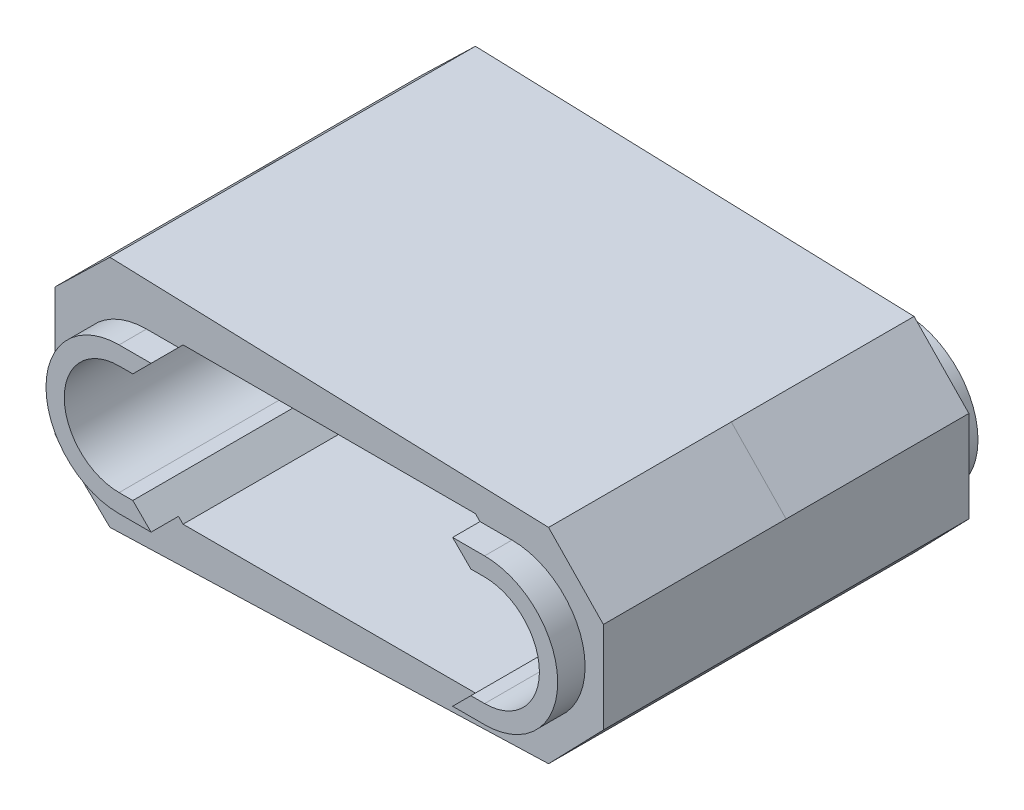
ISO-10303-21;
HEADER;
FILE_DESCRIPTION(('STEP AP214'),'2;1');
FILE_NAME('part.step','',(''),(''),'','','');
FILE_SCHEMA(('AUTOMOTIVE_DESIGN { 1 0 10303 214 1 1 1 1 }'));
ENDSEC;
DATA;
#1=APPLICATION_CONTEXT('core data for automotive mechanical design processes');
#2=APPLICATION_PROTOCOL_DEFINITION('international standard','automotive_design',2000,#1);
#3=PRODUCT_CONTEXT('',#1,'mechanical');
#4=PRODUCT('Part','Part','',(#3));
#5=PRODUCT_RELATED_PRODUCT_CATEGORY('part','',(#4));
#6=PRODUCT_DEFINITION_FORMATION('','',#4);
#7=PRODUCT_DEFINITION_CONTEXT('part definition',#1,'design');
#8=PRODUCT_DEFINITION('design','',#6,#7);
#9=PRODUCT_DEFINITION_SHAPE('','',#8);
#10=(LENGTH_UNIT() NAMED_UNIT(*) SI_UNIT(.MILLI.,.METRE.));
#11=(NAMED_UNIT(*) PLANE_ANGLE_UNIT() SI_UNIT($,.RADIAN.));
#12=(NAMED_UNIT(*) SI_UNIT($,.STERADIAN.) SOLID_ANGLE_UNIT());
#13=UNCERTAINTY_MEASURE_WITH_UNIT(LENGTH_MEASURE(1.E-05),#10,'distance_accuracy_value','');
#14=(GEOMETRIC_REPRESENTATION_CONTEXT(3) GLOBAL_UNCERTAINTY_ASSIGNED_CONTEXT((#13)) GLOBAL_UNIT_ASSIGNED_CONTEXT((#10,
#11,#12)) REPRESENTATION_CONTEXT('',''));
#15=CARTESIAN_POINT('',(0.,0.,0.));
#16=DIRECTION('',(0.,0.,1.));
#17=DIRECTION('',(1.,0.,0.));
#18=AXIS2_PLACEMENT_3D('',#15,#16,#17);
#19=CARTESIAN_POINT('',(0.,-3.,10.));
#20=DIRECTION('',(0.,1.,0.));
#21=DIRECTION('',(-1.,0.,0.));
#22=AXIS2_PLACEMENT_3D('',#19,#20,#21);
#23=PLANE('',#22);
#24=DIRECTION('',(1.,0.,0.));
#25=VECTOR('',#24,1.);
#26=CARTESIAN_POINT('',(0.,-3.,-1.5));
#27=LINE('',#26,#25);
#28=CARTESIAN_POINT('',(24.25,-3.,-1.5));
#29=VERTEX_POINT('',#28);
#30=CARTESIAN_POINT('',(25.,-3.,-1.5));
#31=VERTEX_POINT('',#30);
#32=EDGE_CURVE('E488',#29,#31,#27,.T.);
#33=ORIENTED_EDGE('',*,*,#32,.F.);
#34=DIRECTION('',(0.,0.,1.));
#35=VECTOR('',#34,1.);
#36=CARTESIAN_POINT('',(24.25,-3.,21.5));
#37=LINE('',#36,#35);
#38=CARTESIAN_POINT('',(24.25,-3.,21.5));
#39=VERTEX_POINT('',#38);
#40=EDGE_CURVE('E384',#29,#39,#37,.T.);
#41=ORIENTED_EDGE('',*,*,#40,.T.);
#42=DIRECTION('',(1.,0.,0.));
#43=VECTOR('',#42,1.);
#44=CARTESIAN_POINT('',(0.,-3.,21.5));
#45=LINE('',#44,#43);
#46=CARTESIAN_POINT('',(25.,-3.,21.5));
#47=VERTEX_POINT('',#46);
#48=EDGE_CURVE('E718',#39,#47,#45,.T.);
#49=ORIENTED_EDGE('',*,*,#48,.T.);
#50=DIRECTION('',(0.,0.,-1.));
#51=VECTOR('',#50,1.);
#52=CARTESIAN_POINT('',(25.,-3.,10.));
#53=LINE('',#52,#51);
#54=EDGE_CURVE('E572',#47,#31,#53,.T.);
#55=ORIENTED_EDGE('',*,*,#54,.T.);
#56=EDGE_LOOP('',(#33,#41,#49,#55));
#57=FACE_BOUND('',#56,.T.);
#58=ADVANCED_FACE('F52',(#57),#23,.T.);
#59=CARTESIAN_POINT('',(0.,3.,10.));
#60=DIRECTION('',(0.,1.,0.));
#61=DIRECTION('',(-1.,0.,0.));
#62=AXIS2_PLACEMENT_3D('',#59,#60,#61);
#63=PLANE('',#62);
#64=DIRECTION('',(1.,0.,0.));
#65=VECTOR('',#64,1.);
#66=CARTESIAN_POINT('',(0.,3.,21.5));
#67=LINE('',#66,#65);
#68=CARTESIAN_POINT('',(24.25,3.,21.5));
#69=VERTEX_POINT('',#68);
#70=CARTESIAN_POINT('',(25.,3.,21.5));
#71=VERTEX_POINT('',#70);
#72=EDGE_CURVE('E709',#69,#71,#67,.T.);
#73=ORIENTED_EDGE('',*,*,#72,.F.);
#74=DIRECTION('',(0.,0.,-1.));
#75=VECTOR('',#74,1.);
#76=CARTESIAN_POINT('',(24.25,3.,10.));
#77=LINE('',#76,#75);
#78=CARTESIAN_POINT('',(24.25,3.,-1.5));
#79=VERTEX_POINT('',#78);
#80=EDGE_CURVE('E672',#69,#79,#77,.T.);
#81=ORIENTED_EDGE('',*,*,#80,.T.);
#82=DIRECTION('',(1.,0.,0.));
#83=VECTOR('',#82,1.);
#84=CARTESIAN_POINT('',(0.,3.,-1.5));
#85=LINE('',#84,#83);
#86=CARTESIAN_POINT('',(25.,3.,-1.5));
#87=VERTEX_POINT('',#86);
#88=EDGE_CURVE('E497',#79,#87,#85,.T.);
#89=ORIENTED_EDGE('',*,*,#88,.T.);
#90=DIRECTION('',(0.,0.,-1.));
#91=VECTOR('',#90,1.);
#92=CARTESIAN_POINT('',(25.,3.,10.));
#93=LINE('',#92,#91);
#94=EDGE_CURVE('E562',#71,#87,#93,.T.);
#95=ORIENTED_EDGE('',*,*,#94,.F.);
#96=EDGE_LOOP('',(#73,#81,#89,#95));
#97=FACE_BOUND('',#96,.T.);
#98=ADVANCED_FACE('F910',(#97),#63,.F.);
#99=CARTESIAN_POINT('',(0.,4.,-1.5));
#100=DIRECTION('',(0.,-1.,0.));
#101=DIRECTION('',(0.,0.,-1.));
#102=AXIS2_PLACEMENT_3D('',#99,#100,#101);
#103=PLANE('',#102);
#104=DIRECTION('',(1.,0.,0.));
#105=VECTOR('',#104,1.);
#106=CARTESIAN_POINT('',(0.,4.,-1.5));
#107=LINE('',#106,#105);
#108=CARTESIAN_POINT('',(23.25,4.,-1.5));
#109=VERTEX_POINT('',#108);
#110=CARTESIAN_POINT('',(25.,4.,-1.5));
#111=VERTEX_POINT('',#110);
#112=EDGE_CURVE('E501',#109,#111,#107,.T.);
#113=ORIENTED_EDGE('',*,*,#112,.F.);
#114=DIRECTION('',(0.,0.,-1.));
#115=VECTOR('',#114,1.);
#116=CARTESIAN_POINT('',(23.25,4.,10.));
#117=LINE('',#116,#115);
#118=CARTESIAN_POINT('',(23.25,4.,0.));
#119=VERTEX_POINT('',#118);
#120=EDGE_CURVE('E344',#109,#119,#117,.F.);
#121=ORIENTED_EDGE('',*,*,#120,.T.);
#122=DIRECTION('',(1.,0.,0.));
#123=VECTOR('',#122,1.);
#124=CARTESIAN_POINT('',(0.,4.,0.));
#125=LINE('',#124,#123);
#126=CARTESIAN_POINT('',(25.,4.,0.));
#127=VERTEX_POINT('',#126);
#128=EDGE_CURVE('E484',#119,#127,#125,.T.);
#129=ORIENTED_EDGE('',*,*,#128,.T.);
#130=DIRECTION('',(0.,0.,1.));
#131=VECTOR('',#130,1.);
#132=CARTESIAN_POINT('',(25.,4.,-1.5));
#133=LINE('',#132,#131);
#134=EDGE_CURVE('E533',#111,#127,#133,.T.);
#135=ORIENTED_EDGE('',*,*,#134,.F.);
#136=EDGE_LOOP('',(#113,#121,#129,#135));
#137=FACE_BOUND('',#136,.T.);
#138=ADVANCED_FACE('F690',(#137),#103,.F.);
#139=CARTESIAN_POINT('',(0.,-4.,-1.5));
#140=DIRECTION('',(0.,-1.,0.));
#141=DIRECTION('',(1.,0.,0.));
#142=AXIS2_PLACEMENT_3D('',#139,#140,#141);
#143=PLANE('',#142);
#144=DIRECTION('',(1.,0.,0.));
#145=VECTOR('',#144,1.);
#146=CARTESIAN_POINT('',(0.,-4.,0.));
#147=LINE('',#146,#145);
#148=CARTESIAN_POINT('',(23.25,-4.,0.));
#149=VERTEX_POINT('',#148);
#150=CARTESIAN_POINT('',(25.,-4.,0.));
#151=VERTEX_POINT('',#150);
#152=EDGE_CURVE('E525',#149,#151,#147,.T.);
#153=ORIENTED_EDGE('',*,*,#152,.F.);
#154=DIRECTION('',(0.,0.,-1.));
#155=VECTOR('',#154,1.);
#156=CARTESIAN_POINT('',(23.25,-4.,-1.5));
#157=LINE('',#156,#155);
#158=CARTESIAN_POINT('',(23.25,-4.,-1.5));
#159=VERTEX_POINT('',#158);
#160=EDGE_CURVE('E381',#149,#159,#157,.T.);
#161=ORIENTED_EDGE('',*,*,#160,.T.);
#162=DIRECTION('',(1.,0.,0.));
#163=VECTOR('',#162,1.);
#164=CARTESIAN_POINT('',(0.,-4.,-1.5));
#165=LINE('',#164,#163);
#166=CARTESIAN_POINT('',(25.,-4.,-1.5));
#167=VERTEX_POINT('',#166);
#168=EDGE_CURVE('E509',#159,#167,#165,.T.);
#169=ORIENTED_EDGE('',*,*,#168,.T.);
#170=DIRECTION('',(0.,0.,1.));
#171=VECTOR('',#170,1.);
#172=CARTESIAN_POINT('',(25.,-4.,-1.5));
#173=LINE('',#172,#171);
#174=EDGE_CURVE('E538',#167,#151,#173,.T.);
#175=ORIENTED_EDGE('',*,*,#174,.T.);
#176=EDGE_LOOP('',(#153,#161,#169,#175));
#177=FACE_BOUND('',#176,.T.);
#178=ADVANCED_FACE('F890',(#177),#143,.T.);
#179=CARTESIAN_POINT('',(0.,0.,-1.5));
#180=DIRECTION('',(0.,0.,1.));
#181=DIRECTION('',(1.,0.,0.));
#182=AXIS2_PLACEMENT_3D('',#179,#180,#181);
#183=PLANE('',#182);
#184=ORIENTED_EDGE('',*,*,#88,.F.);
#185=DIRECTION('',(0.707106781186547,-0.707106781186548,0.));
#186=VECTOR('',#185,1.);
#187=CARTESIAN_POINT('',(24.25,3.,-1.5));
#188=LINE('',#187,#186);
#189=EDGE_CURVE('E352',#79,#109,#188,.F.);
#190=ORIENTED_EDGE('',*,*,#189,.T.);
#191=ORIENTED_EDGE('',*,*,#112,.T.);
#192=CARTESIAN_POINT('',(25.,0.,-1.5));
#193=DIRECTION('',(0.,0.,1.));
#194=DIRECTION('',(1.,0.,0.));
#195=AXIS2_PLACEMENT_3D('',#192,#193,#194);
#196=CIRCLE('',#195,4.);
#197=EDGE_CURVE('E513',#167,#111,#196,.T.);
#198=ORIENTED_EDGE('',*,*,#197,.F.);
#199=ORIENTED_EDGE('',*,*,#168,.F.);
#200=DIRECTION('',(0.707106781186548,0.707106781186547,0.));
#201=VECTOR('',#200,1.);
#202=CARTESIAN_POINT('',(23.,-4.25,-1.5));
#203=LINE('',#202,#201);
#204=EDGE_CURVE('E676',#159,#29,#203,.T.);
#205=ORIENTED_EDGE('',*,*,#204,.T.);
#206=ORIENTED_EDGE('',*,*,#32,.T.);
#207=CARTESIAN_POINT('',(25.,0.,-1.5));
#208=DIRECTION('',(0.,0.,1.));
#209=DIRECTION('',(1.,0.,0.));
#210=AXIS2_PLACEMENT_3D('',#207,#208,#209);
#211=CIRCLE('',#210,3.);
#212=EDGE_CURVE('E485',#31,#87,#211,.T.);
#213=ORIENTED_EDGE('',*,*,#212,.T.);
#214=EDGE_LOOP('',(#184,#190,#191,#198,#199,#205,#206,#213));
#215=FACE_BOUND('',#214,.T.);
#216=ADVANCED_FACE('F683',(#215),#183,.F.);
#217=CARTESIAN_POINT('',(0.,4.,21.5));
#218=DIRECTION('',(0.,1.,0.));
#219=DIRECTION('',(0.,0.,1.));
#220=AXIS2_PLACEMENT_3D('',#217,#218,#219);
#221=PLANE('',#220);
#222=DIRECTION('',(1.,0.,0.));
#223=VECTOR('',#222,1.);
#224=CARTESIAN_POINT('',(0.,4.,20.));
#225=LINE('',#224,#223);
#226=CARTESIAN_POINT('',(23.25,4.,20.));
#227=VERTEX_POINT('',#226);
#228=CARTESIAN_POINT('',(25.,4.,20.));
#229=VERTEX_POINT('',#228);
#230=EDGE_CURVE('E432',#227,#229,#225,.T.);
#231=ORIENTED_EDGE('',*,*,#230,.F.);
#232=DIRECTION('',(0.,0.,-1.));
#233=VECTOR('',#232,1.);
#234=CARTESIAN_POINT('',(23.25,4.,21.5));
#235=LINE('',#234,#233);
#236=CARTESIAN_POINT('',(23.25,4.,21.5));
#237=VERTEX_POINT('',#236);
#238=EDGE_CURVE('E372',#227,#237,#235,.F.);
#239=ORIENTED_EDGE('',*,*,#238,.T.);
#240=DIRECTION('',(1.,0.,0.));
#241=VECTOR('',#240,1.);
#242=CARTESIAN_POINT('',(0.,4.,21.5));
#243=LINE('',#242,#241);
#244=CARTESIAN_POINT('',(25.,4.,21.5));
#245=VERTEX_POINT('',#244);
#246=EDGE_CURVE('E723',#237,#245,#243,.T.);
#247=ORIENTED_EDGE('',*,*,#246,.T.);
#248=DIRECTION('',(0.,0.,-1.));
#249=VECTOR('',#248,1.);
#250=CARTESIAN_POINT('',(25.,4.,21.5));
#251=LINE('',#250,#249);
#252=EDGE_CURVE('E465',#245,#229,#251,.T.);
#253=ORIENTED_EDGE('',*,*,#252,.T.);
#254=EDGE_LOOP('',(#231,#239,#247,#253));
#255=FACE_BOUND('',#254,.T.);
#256=ADVANCED_FACE('F759',(#255),#221,.T.);
#257=CARTESIAN_POINT('',(0.,-4.,21.5));
#258=DIRECTION('',(0.,1.,0.));
#259=DIRECTION('',(-1.,0.,0.));
#260=AXIS2_PLACEMENT_3D('',#257,#258,#259);
#261=PLANE('',#260);
#262=DIRECTION('',(1.,0.,0.));
#263=VECTOR('',#262,1.);
#264=CARTESIAN_POINT('',(0.,-4.,21.5));
#265=LINE('',#264,#263);
#266=CARTESIAN_POINT('',(23.25,-4.,21.5));
#267=VERTEX_POINT('',#266);
#268=CARTESIAN_POINT('',(25.,-4.,21.5));
#269=VERTEX_POINT('',#268);
#270=EDGE_CURVE('E729',#267,#269,#265,.T.);
#271=ORIENTED_EDGE('',*,*,#270,.F.);
#272=DIRECTION('',(0.,0.,-1.));
#273=VECTOR('',#272,1.);
#274=CARTESIAN_POINT('',(23.25,-4.,-1.5));
#275=LINE('',#274,#273);
#276=CARTESIAN_POINT('',(23.25,-4.,20.));
#277=VERTEX_POINT('',#276);
#278=EDGE_CURVE('E387',#267,#277,#275,.T.);
#279=ORIENTED_EDGE('',*,*,#278,.T.);
#280=DIRECTION('',(1.,0.,0.));
#281=VECTOR('',#280,1.);
#282=CARTESIAN_POINT('',(0.,-4.,20.));
#283=LINE('',#282,#281);
#284=CARTESIAN_POINT('',(25.,-4.,20.));
#285=VERTEX_POINT('',#284);
#286=EDGE_CURVE('E438',#277,#285,#283,.T.);
#287=ORIENTED_EDGE('',*,*,#286,.T.);
#288=DIRECTION('',(0.,0.,-1.));
#289=VECTOR('',#288,1.);
#290=CARTESIAN_POINT('',(25.,-4.,21.5));
#291=LINE('',#290,#289);
#292=EDGE_CURVE('E461',#269,#285,#291,.T.);
#293=ORIENTED_EDGE('',*,*,#292,.F.);
#294=EDGE_LOOP('',(#271,#279,#287,#293));
#295=FACE_BOUND('',#294,.T.);
#296=ADVANCED_FACE('F752',(#295),#261,.F.);
#297=CARTESIAN_POINT('',(0.,0.,21.5));
#298=DIRECTION('',(0.,0.,-1.));
#299=DIRECTION('',(1.,0.,0.));
#300=AXIS2_PLACEMENT_3D('',#297,#298,#299);
#301=PLANE('',#300);
#302=ORIENTED_EDGE('',*,*,#246,.F.);
#303=DIRECTION('',(-0.707106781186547,0.707106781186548,0.));
#304=VECTOR('',#303,1.);
#305=CARTESIAN_POINT('',(24.25,3.,21.5));
#306=LINE('',#305,#304);
#307=EDGE_CURVE('E378',#237,#69,#306,.F.);
#308=ORIENTED_EDGE('',*,*,#307,.T.);
#309=ORIENTED_EDGE('',*,*,#72,.T.);
#310=CARTESIAN_POINT('',(25.,0.,21.5));
#311=DIRECTION('',(0.,0.,1.));
#312=DIRECTION('',(1.,0.,0.));
#313=AXIS2_PLACEMENT_3D('',#310,#311,#312);
#314=CIRCLE('',#313,3.);
#315=EDGE_CURVE('E452',#47,#71,#314,.T.);
#316=ORIENTED_EDGE('',*,*,#315,.F.);
#317=ORIENTED_EDGE('',*,*,#48,.F.);
#318=DIRECTION('',(-0.707106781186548,-0.707106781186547,0.));
#319=VECTOR('',#318,1.);
#320=CARTESIAN_POINT('',(23.,-4.25,21.5));
#321=LINE('',#320,#319);
#322=EDGE_CURVE('E375',#39,#267,#321,.T.);
#323=ORIENTED_EDGE('',*,*,#322,.T.);
#324=ORIENTED_EDGE('',*,*,#270,.T.);
#325=CARTESIAN_POINT('',(25.,0.,21.5));
#326=DIRECTION('',(0.,0.,1.));
#327=DIRECTION('',(1.,0.,0.));
#328=AXIS2_PLACEMENT_3D('',#325,#326,#327);
#329=CIRCLE('',#328,4.);
#330=EDGE_CURVE('E726',#269,#245,#329,.T.);
#331=ORIENTED_EDGE('',*,*,#330,.T.);
#332=EDGE_LOOP('',(#302,#308,#309,#316,#317,#323,#324,#331));
#333=FACE_BOUND('',#332,.T.);
#334=ADVANCED_FACE('F743',(#333),#301,.F.);
#335=CARTESIAN_POINT('',(0.,0.,20.));
#336=DIRECTION('',(0.,0.,-1.));
#337=DIRECTION('',(1.,0.,0.));
#338=AXIS2_PLACEMENT_3D('',#335,#336,#337);
#339=PLANE('',#338);
#340=DIRECTION('',(0.999444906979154,0.0333148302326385,0.));
#341=VECTOR('',#340,1.);
#342=CARTESIAN_POINT('',(0.216426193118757,-6.49278579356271,20.));
#343=LINE('',#342,#341);
#344=CARTESIAN_POINT('',(2.99833472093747,-6.40005550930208,20.));
#345=VERTEX_POINT('',#344);
#346=CARTESIAN_POINT('',(27.0016652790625,-5.59994449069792,20.));
#347=VERTEX_POINT('',#346);
#348=EDGE_CURVE('E472',#345,#347,#343,.T.);
#349=ORIENTED_EDGE('',*,*,#348,.T.);
#350=DIRECTION('',(0.695228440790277,0.718788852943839,0.));
#351=VECTOR('',#350,1.);
#352=CARTESIAN_POINT('',(27.0016652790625,-5.59994449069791,20.));
#353=LINE('',#352,#351);
#354=CARTESIAN_POINT('',(30.,-2.5,20.));
#355=VERTEX_POINT('',#354);
#356=EDGE_CURVE('E646',#347,#355,#353,.T.);
#357=ORIENTED_EDGE('',*,*,#356,.T.);
#358=DIRECTION('',(0.,-1.,0.));
#359=VECTOR('',#358,1.);
#360=CARTESIAN_POINT('',(30.,0.,20.));
#361=LINE('',#360,#359);
#362=CARTESIAN_POINT('',(30.,2.49999999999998,20.));
#363=VERTEX_POINT('',#362);
#364=EDGE_CURVE('E456',#363,#355,#361,.T.);
#365=ORIENTED_EDGE('',*,*,#364,.F.);
#366=DIRECTION('',(0.695228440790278,-0.718788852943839,0.));
#367=VECTOR('',#366,1.);
#368=CARTESIAN_POINT('',(30.,2.49999999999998,20.));
#369=LINE('',#368,#367);
#370=CARTESIAN_POINT('',(27.0016652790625,5.59994449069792,20.));
#371=VERTEX_POINT('',#370);
#372=EDGE_CURVE('E643',#363,#371,#369,.F.);
#373=ORIENTED_EDGE('',*,*,#372,.T.);
#374=DIRECTION('',(0.999444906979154,-0.0333148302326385,0.));
#375=VECTOR('',#374,1.);
#376=CARTESIAN_POINT('',(0.216426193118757,6.49278579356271,20.));
#377=LINE('',#376,#375);
#378=CARTESIAN_POINT('',(2.99833472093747,6.40005550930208,20.));
#379=VERTEX_POINT('',#378);
#380=EDGE_CURVE('E480',#379,#371,#377,.T.);
#381=ORIENTED_EDGE('',*,*,#380,.F.);
#382=DIRECTION('',(-0.718788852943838,-0.695228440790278,0.));
#383=VECTOR('',#382,1.);
#384=CARTESIAN_POINT('',(2.99833472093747,6.40005550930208,20.));
#385=LINE('',#384,#383);
#386=CARTESIAN_POINT('',(0.,3.49999999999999,20.));
#387=VERTEX_POINT('',#386);
#388=EDGE_CURVE('E637',#379,#387,#385,.T.);
#389=ORIENTED_EDGE('',*,*,#388,.T.);
#390=DIRECTION('',(0.,-1.,0.));
#391=VECTOR('',#390,1.);
#392=CARTESIAN_POINT('',(0.,0.,20.));
#393=LINE('',#392,#391);
#394=CARTESIAN_POINT('',(0.,-3.49999999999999,20.));
#395=VERTEX_POINT('',#394);
#396=EDGE_CURVE('E476',#387,#395,#393,.T.);
#397=ORIENTED_EDGE('',*,*,#396,.T.);
#398=DIRECTION('',(-0.718788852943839,0.695228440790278,0.));
#399=VECTOR('',#398,1.);
#400=CARTESIAN_POINT('',(0.,-3.49999999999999,20.));
#401=LINE('',#400,#399);
#402=EDGE_CURVE('E640',#395,#345,#401,.F.);
#403=ORIENTED_EDGE('',*,*,#402,.T.);
#404=EDGE_LOOP('',(#349,#357,#365,#373,#381,#389,#397,#403));
#405=FACE_BOUND('',#404,.T.);
#406=DIRECTION('',(1.,0.,0.));
#407=VECTOR('',#406,1.);
#408=CARTESIAN_POINT('',(0.,4.25,20.));
#409=LINE('',#408,#407);
#410=CARTESIAN_POINT('',(7.,4.25,20.));
#411=VERTEX_POINT('',#410);
#412=CARTESIAN_POINT('',(23.,4.25,20.));
#413=VERTEX_POINT('',#412);
#414=EDGE_CURVE('E320',#411,#413,#409,.T.);
#415=ORIENTED_EDGE('',*,*,#414,.T.);
#416=DIRECTION('',(-0.707106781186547,0.707106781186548,0.));
#417=VECTOR('',#416,1.);
#418=CARTESIAN_POINT('',(24.25,3.,20.));
#419=LINE('',#418,#417);
#420=EDGE_CURVE('E369',#413,#227,#419,.F.);
#421=ORIENTED_EDGE('',*,*,#420,.T.);
#422=ORIENTED_EDGE('',*,*,#230,.T.);
#423=CARTESIAN_POINT('',(25.,0.,20.));
#424=DIRECTION('',(0.,0.,1.));
#425=DIRECTION('',(1.,0.,0.));
#426=AXIS2_PLACEMENT_3D('',#423,#424,#425);
#427=CIRCLE('',#426,4.);
#428=EDGE_CURVE('E431',#285,#229,#427,.T.);
#429=ORIENTED_EDGE('',*,*,#428,.F.);
#430=ORIENTED_EDGE('',*,*,#286,.F.);
#431=DIRECTION('',(-0.707106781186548,-0.707106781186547,0.));
#432=VECTOR('',#431,1.);
#433=CARTESIAN_POINT('',(23.,-4.25,20.));
#434=LINE('',#433,#432);
#435=CARTESIAN_POINT('',(23.,-4.25,20.));
#436=VERTEX_POINT('',#435);
#437=EDGE_CURVE('E366',#277,#436,#434,.T.);
#438=ORIENTED_EDGE('',*,*,#437,.T.);
#439=DIRECTION('',(-1.,0.,0.));
#440=VECTOR('',#439,1.);
#441=CARTESIAN_POINT('',(0.,-4.25,20.));
#442=LINE('',#441,#440);
#443=CARTESIAN_POINT('',(7.,-4.25,20.));
#444=VERTEX_POINT('',#443);
#445=EDGE_CURVE('E441',#436,#444,#442,.T.);
#446=ORIENTED_EDGE('',*,*,#445,.T.);
#447=DIRECTION('',(-0.707106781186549,0.707106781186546,0.));
#448=VECTOR('',#447,1.);
#449=CARTESIAN_POINT('',(7.,-4.25,20.));
#450=LINE('',#449,#448);
#451=CARTESIAN_POINT('',(6.74999999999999,-4.,20.));
#452=VERTEX_POINT('',#451);
#453=EDGE_CURVE('E363',#444,#452,#450,.T.);
#454=ORIENTED_EDGE('',*,*,#453,.T.);
#455=CARTESIAN_POINT('',(5.,-4.,20.));
#456=VERTEX_POINT('',#455);
#457=EDGE_CURVE('E446',#456,#452,#283,.T.);
#458=ORIENTED_EDGE('',*,*,#457,.F.);
#459=CARTESIAN_POINT('',(5.,0.,20.));
#460=DIRECTION('',(0.,0.,1.));
#461=DIRECTION('',(1.,0.,0.));
#462=AXIS2_PLACEMENT_3D('',#459,#460,#461);
#463=CIRCLE('',#462,4.);
#464=CARTESIAN_POINT('',(5.,4.,20.));
#465=VERTEX_POINT('',#464);
#466=EDGE_CURVE('E428',#465,#456,#463,.T.);
#467=ORIENTED_EDGE('',*,*,#466,.F.);
#468=CARTESIAN_POINT('',(6.74999999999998,4.,20.));
#469=VERTEX_POINT('',#468);
#470=EDGE_CURVE('E422',#465,#469,#225,.T.);
#471=ORIENTED_EDGE('',*,*,#470,.T.);
#472=DIRECTION('',(-0.707106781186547,-0.707106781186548,0.));
#473=VECTOR('',#472,1.);
#474=CARTESIAN_POINT('',(5.74999999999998,3.,20.));
#475=LINE('',#474,#473);
#476=EDGE_CURVE('E360',#469,#411,#475,.F.);
#477=ORIENTED_EDGE('',*,*,#476,.T.);
#478=EDGE_LOOP('',(#415,#421,#422,#429,#430,#438,#446,#454,#458,#467,#471,#477));
#479=FACE_BOUND('',#478,.T.);
#480=ADVANCED_FACE('F426',(#405,#479),#339,.F.);
#481=CARTESIAN_POINT('',(0.,0.,0.));
#482=DIRECTION('',(0.,0.,1.));
#483=DIRECTION('',(1.,0.,0.));
#484=AXIS2_PLACEMENT_3D('',#481,#482,#483);
#485=PLANE('',#484);
#486=ORIENTED_EDGE('',*,*,#128,.F.);
#487=DIRECTION('',(0.707106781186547,-0.707106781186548,0.));
#488=VECTOR('',#487,1.);
#489=CARTESIAN_POINT('',(24.25,3.,0.));
#490=LINE('',#489,#488);
#491=CARTESIAN_POINT('',(23.,4.25,0.));
#492=VERTEX_POINT('',#491);
#493=EDGE_CURVE('E336',#119,#492,#490,.F.);
#494=ORIENTED_EDGE('',*,*,#493,.T.);
#495=DIRECTION('',(-1.,0.,0.));
#496=VECTOR('',#495,1.);
#497=CARTESIAN_POINT('',(0.,4.25,0.));
#498=LINE('',#497,#496);
#499=CARTESIAN_POINT('',(7.,4.25,0.));
#500=VERTEX_POINT('',#499);
#501=EDGE_CURVE('E317',#492,#500,#498,.T.);
#502=ORIENTED_EDGE('',*,*,#501,.T.);
#503=DIRECTION('',(0.707106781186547,0.707106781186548,0.));
#504=VECTOR('',#503,1.);
#505=CARTESIAN_POINT('',(5.74999999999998,3.,0.));
#506=LINE('',#505,#504);
#507=CARTESIAN_POINT('',(6.74999999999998,4.,0.));
#508=VERTEX_POINT('',#507);
#509=EDGE_CURVE('E333',#500,#508,#506,.F.);
#510=ORIENTED_EDGE('',*,*,#509,.T.);
#511=CARTESIAN_POINT('',(5.,4.,0.));
#512=VERTEX_POINT('',#511);
#513=EDGE_CURVE('E518',#512,#508,#125,.T.);
#514=ORIENTED_EDGE('',*,*,#513,.F.);
#515=CARTESIAN_POINT('',(5.,0.,0.));
#516=DIRECTION('',(0.,0.,1.));
#517=DIRECTION('',(1.,0.,0.));
#518=AXIS2_PLACEMENT_3D('',#515,#516,#517);
#519=CIRCLE('',#518,4.);
#520=CARTESIAN_POINT('',(5.,-4.,0.));
#521=VERTEX_POINT('',#520);
#522=EDGE_CURVE('E521',#512,#521,#519,.T.);
#523=ORIENTED_EDGE('',*,*,#522,.T.);
#524=CARTESIAN_POINT('',(6.74999999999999,-4.,0.));
#525=VERTEX_POINT('',#524);
#526=EDGE_CURVE('E526',#521,#525,#147,.T.);
#527=ORIENTED_EDGE('',*,*,#526,.T.);
#528=DIRECTION('',(0.707106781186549,-0.707106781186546,0.));
#529=VECTOR('',#528,1.);
#530=CARTESIAN_POINT('',(7.,-4.25,0.));
#531=LINE('',#530,#529);
#532=CARTESIAN_POINT('',(7.,-4.25,0.));
#533=VERTEX_POINT('',#532);
#534=EDGE_CURVE('E343',#525,#533,#531,.T.);
#535=ORIENTED_EDGE('',*,*,#534,.T.);
#536=DIRECTION('',(1.,0.,0.));
#537=VECTOR('',#536,1.);
#538=CARTESIAN_POINT('',(0.,-4.25,0.));
#539=LINE('',#538,#537);
#540=CARTESIAN_POINT('',(23.,-4.25,0.));
#541=VERTEX_POINT('',#540);
#542=EDGE_CURVE('E338',#533,#541,#539,.T.);
#543=ORIENTED_EDGE('',*,*,#542,.T.);
#544=DIRECTION('',(0.707106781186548,0.707106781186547,0.));
#545=VECTOR('',#544,1.);
#546=CARTESIAN_POINT('',(23.,-4.25,0.));
#547=LINE('',#546,#545);
#548=EDGE_CURVE('E349',#541,#149,#547,.T.);
#549=ORIENTED_EDGE('',*,*,#548,.T.);
#550=ORIENTED_EDGE('',*,*,#152,.T.);
#551=CARTESIAN_POINT('',(25.,0.,0.));
#552=DIRECTION('',(0.,0.,1.));
#553=DIRECTION('',(1.,0.,0.));
#554=AXIS2_PLACEMENT_3D('',#551,#552,#553);
#555=CIRCLE('',#554,4.);
#556=EDGE_CURVE('E489',#151,#127,#555,.T.);
#557=ORIENTED_EDGE('',*,*,#556,.T.);
#558=EDGE_LOOP('',(#486,#494,#502,#510,#514,#523,#527,#535,#543,#549,#550,#557));
#559=FACE_BOUND('',#558,.T.);
#560=DIRECTION('',(0.,-1.,0.));
#561=VECTOR('',#560,1.);
#562=CARTESIAN_POINT('',(30.,0.,0.));
#563=LINE('',#562,#561);
#564=CARTESIAN_POINT('',(30.,2.49999999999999,0.));
#565=VERTEX_POINT('',#564);
#566=CARTESIAN_POINT('',(30.,-2.5,0.));
#567=VERTEX_POINT('',#566);
#568=EDGE_CURVE('E537',#565,#567,#563,.T.);
#569=ORIENTED_EDGE('',*,*,#568,.T.);
#570=DIRECTION('',(-0.695228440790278,-0.718788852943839,0.));
#571=VECTOR('',#570,1.);
#572=CARTESIAN_POINT('',(30.,-2.5,0.));
#573=LINE('',#572,#571);
#574=CARTESIAN_POINT('',(27.0016652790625,-5.59994449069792,0.));
#575=VERTEX_POINT('',#574);
#576=EDGE_CURVE('E591',#567,#575,#573,.T.);
#577=ORIENTED_EDGE('',*,*,#576,.T.);
#578=DIRECTION('',(0.999444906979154,0.0333148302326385,0.));
#579=VECTOR('',#578,1.);
#580=CARTESIAN_POINT('',(0.216426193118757,-6.49278579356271,0.));
#581=LINE('',#580,#579);
#582=CARTESIAN_POINT('',(2.99833472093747,-6.40005550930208,0.));
#583=VERTEX_POINT('',#582);
#584=EDGE_CURVE('E558',#583,#575,#581,.T.);
#585=ORIENTED_EDGE('',*,*,#584,.F.);
#586=DIRECTION('',(0.718788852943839,-0.695228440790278,0.));
#587=VECTOR('',#586,1.);
#588=CARTESIAN_POINT('',(2.99833472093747,-6.40005550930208,0.));
#589=LINE('',#588,#587);
#590=CARTESIAN_POINT('',(0.,-3.49999999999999,0.));
#591=VERTEX_POINT('',#590);
#592=EDGE_CURVE('E586',#583,#591,#589,.F.);
#593=ORIENTED_EDGE('',*,*,#592,.T.);
#594=DIRECTION('',(0.,-1.,0.));
#595=VECTOR('',#594,1.);
#596=CARTESIAN_POINT('',(0.,0.,0.));
#597=LINE('',#596,#595);
#598=CARTESIAN_POINT('',(0.,3.49999999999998,0.));
#599=VERTEX_POINT('',#598);
#600=EDGE_CURVE('E554',#599,#591,#597,.T.);
#601=ORIENTED_EDGE('',*,*,#600,.F.);
#602=DIRECTION('',(0.718788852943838,0.695228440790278,0.));
#603=VECTOR('',#602,1.);
#604=CARTESIAN_POINT('',(0.,3.49999999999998,0.));
#605=LINE('',#604,#603);
#606=CARTESIAN_POINT('',(2.99833472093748,6.40005550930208,0.));
#607=VERTEX_POINT('',#606);
#608=EDGE_CURVE('E583',#599,#607,#605,.T.);
#609=ORIENTED_EDGE('',*,*,#608,.T.);
#610=DIRECTION('',(0.999444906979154,-0.0333148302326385,0.));
#611=VECTOR('',#610,1.);
#612=CARTESIAN_POINT('',(0.216426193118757,6.49278579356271,0.));
#613=LINE('',#612,#611);
#614=CARTESIAN_POINT('',(27.0016652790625,5.59994449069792,0.));
#615=VERTEX_POINT('',#614);
#616=EDGE_CURVE('E550',#607,#615,#613,.T.);
#617=ORIENTED_EDGE('',*,*,#616,.T.);
#618=DIRECTION('',(-0.695228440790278,0.718788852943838,0.));
#619=VECTOR('',#618,1.);
#620=CARTESIAN_POINT('',(27.0016652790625,5.59994449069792,0.));
#621=LINE('',#620,#619);
#622=EDGE_CURVE('E589',#615,#565,#621,.F.);
#623=ORIENTED_EDGE('',*,*,#622,.T.);
#624=EDGE_LOOP('',(#569,#577,#585,#593,#601,#609,#617,#623));
#625=FACE_BOUND('',#624,.T.);
#626=ADVANCED_FACE('F330',(#559,#625),#485,.F.);
#627=CARTESIAN_POINT('',(25.,0.,10.));
#628=DIRECTION('',(0.,0.,-1.));
#629=DIRECTION('',(-1.,0.,0.));
#630=AXIS2_PLACEMENT_3D('',#627,#628,#629);
#631=CYLINDRICAL_SURFACE('',#630,3.);
#632=ORIENTED_EDGE('',*,*,#94,.T.);
#633=ORIENTED_EDGE('',*,*,#212,.F.);
#634=ORIENTED_EDGE('',*,*,#54,.F.);
#635=ORIENTED_EDGE('',*,*,#315,.T.);
#636=EDGE_LOOP('',(#632,#633,#634,#635));
#637=FACE_BOUND('',#636,.T.);
#638=ADVANCED_FACE('F906',(#637),#631,.F.);
#639=CARTESIAN_POINT('',(5.,-3.,21.5));
#640=VERTEX_POINT('',#639);
#641=CARTESIAN_POINT('',(5.74999999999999,-3.,21.5));
#642=VERTEX_POINT('',#641);
#643=EDGE_CURVE('E719',#640,#642,#45,.T.);
#644=ORIENTED_EDGE('',*,*,#643,.T.);
#645=DIRECTION('',(0.,0.,-1.));
#646=VECTOR('',#645,1.);
#647=CARTESIAN_POINT('',(5.74999999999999,-3.,-1.5));
#648=LINE('',#647,#646);
#649=CARTESIAN_POINT('',(5.74999999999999,-3.,-1.5));
#650=VERTEX_POINT('',#649);
#651=EDGE_CURVE('E399',#642,#650,#648,.T.);
#652=ORIENTED_EDGE('',*,*,#651,.T.);
#653=CARTESIAN_POINT('',(5.,-3.,-1.5));
#654=VERTEX_POINT('',#653);
#655=EDGE_CURVE('E490',#654,#650,#27,.T.);
#656=ORIENTED_EDGE('',*,*,#655,.F.);
#657=DIRECTION('',(0.,0.,-1.));
#658=VECTOR('',#657,1.);
#659=CARTESIAN_POINT('',(5.,-3.,10.));
#660=LINE('',#659,#658);
#661=EDGE_CURVE('E569',#640,#654,#660,.T.);
#662=ORIENTED_EDGE('',*,*,#661,.F.);
#663=EDGE_LOOP('',(#644,#652,#656,#662));
#664=FACE_BOUND('',#663,.T.);
#665=ADVANCED_FACE('F939',(#664),#23,.T.);
#666=CARTESIAN_POINT('',(5.,0.,10.));
#667=DIRECTION('',(0.,0.,-1.));
#668=DIRECTION('',(-1.,0.,0.));
#669=AXIS2_PLACEMENT_3D('',#666,#667,#668);
#670=CYLINDRICAL_SURFACE('',#669,3.);
#671=ORIENTED_EDGE('',*,*,#661,.T.);
#672=CARTESIAN_POINT('',(5.,0.,-1.5));
#673=DIRECTION('',(0.,0.,1.));
#674=DIRECTION('',(1.,0.,0.));
#675=AXIS2_PLACEMENT_3D('',#672,#673,#674);
#676=CIRCLE('',#675,3.);
#677=CARTESIAN_POINT('',(5.,3.,-1.5));
#678=VERTEX_POINT('',#677);
#679=EDGE_CURVE('E493',#678,#654,#676,.T.);
#680=ORIENTED_EDGE('',*,*,#679,.F.);
#681=DIRECTION('',(0.,0.,-1.));
#682=VECTOR('',#681,1.);
#683=CARTESIAN_POINT('',(5.,3.,10.));
#684=LINE('',#683,#682);
#685=CARTESIAN_POINT('',(5.,3.,21.5));
#686=VERTEX_POINT('',#685);
#687=EDGE_CURVE('E566',#686,#678,#684,.T.);
#688=ORIENTED_EDGE('',*,*,#687,.F.);
#689=CARTESIAN_POINT('',(5.,0.,21.5));
#690=DIRECTION('',(0.,0.,1.));
#691=DIRECTION('',(1.,0.,0.));
#692=AXIS2_PLACEMENT_3D('',#689,#690,#691);
#693=CIRCLE('',#692,3.);
#694=EDGE_CURVE('E714',#686,#640,#693,.T.);
#695=ORIENTED_EDGE('',*,*,#694,.T.);
#696=EDGE_LOOP('',(#671,#680,#688,#695));
#697=FACE_BOUND('',#696,.T.);
#698=ADVANCED_FACE('F973',(#697),#670,.F.);
#699=CARTESIAN_POINT('',(30.,0.,10.));
#700=DIRECTION('',(1.,0.,0.));
#701=DIRECTION('',(0.,0.,-1.));
#702=AXIS2_PLACEMENT_3D('',#699,#700,#701);
#703=PLANE('',#702);
#704=ORIENTED_EDGE('',*,*,#364,.T.);
#705=DIRECTION('',(0.,0.,-1.));
#706=VECTOR('',#705,1.);
#707=CARTESIAN_POINT('',(30.,-2.5,10.));
#708=LINE('',#707,#706);
#709=CARTESIAN_POINT('',(30.,-2.5,10.));
#710=VERTEX_POINT('',#709);
#711=EDGE_CURVE('E653',#355,#710,#708,.T.);
#712=ORIENTED_EDGE('',*,*,#711,.T.);
#713=DIRECTION('',(0.,0.,-1.));
#714=VECTOR('',#713,1.);
#715=CARTESIAN_POINT('',(30.,-2.5,0.));
#716=LINE('',#715,#714);
#717=EDGE_CURVE('E579',#710,#567,#716,.T.);
#718=ORIENTED_EDGE('',*,*,#717,.T.);
#719=ORIENTED_EDGE('',*,*,#568,.F.);
#720=DIRECTION('',(0.,0.,1.));
#721=VECTOR('',#720,1.);
#722=CARTESIAN_POINT('',(30.,2.49999999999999,10.));
#723=LINE('',#722,#721);
#724=CARTESIAN_POINT('',(30.,2.49999999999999,10.));
#725=VERTEX_POINT('',#724);
#726=EDGE_CURVE('E576',#565,#725,#723,.T.);
#727=ORIENTED_EDGE('',*,*,#726,.T.);
#728=DIRECTION('',(0.,0.,1.));
#729=VECTOR('',#728,1.);
#730=CARTESIAN_POINT('',(30.,2.49999999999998,10.));
#731=LINE('',#730,#729);
#732=EDGE_CURVE('E649',#725,#363,#731,.T.);
#733=ORIENTED_EDGE('',*,*,#732,.T.);
#734=EDGE_LOOP('',(#704,#712,#718,#719,#727,#733));
#735=FACE_BOUND('',#734,.T.);
#736=ADVANCED_FACE('F977',(#735),#703,.T.);
#737=CARTESIAN_POINT('',(0.216426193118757,6.49278579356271,10.));
#738=DIRECTION('',(0.0333148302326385,0.999444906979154,0.));
#739=DIRECTION('',(-0.999444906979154,0.0333148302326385,0.));
#740=AXIS2_PLACEMENT_3D('',#737,#738,#739);
#741=PLANE('',#740);
#742=ORIENTED_EDGE('',*,*,#380,.T.);
#743=DIRECTION('',(0.,0.,-1.));
#744=VECTOR('',#743,1.);
#745=CARTESIAN_POINT('',(27.0016652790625,5.59994449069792,10.));
#746=LINE('',#745,#744);
#747=CARTESIAN_POINT('',(27.0016652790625,5.59994449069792,10.));
#748=VERTEX_POINT('',#747);
#749=EDGE_CURVE('E660',#371,#748,#746,.T.);
#750=ORIENTED_EDGE('',*,*,#749,.T.);
#751=DIRECTION('',(0.,0.,-1.));
#752=VECTOR('',#751,1.);
#753=CARTESIAN_POINT('',(27.0016652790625,5.59994449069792,10.));
#754=LINE('',#753,#752);
#755=EDGE_CURVE('E620',#748,#615,#754,.T.);
#756=ORIENTED_EDGE('',*,*,#755,.T.);
#757=ORIENTED_EDGE('',*,*,#616,.F.);
#758=DIRECTION('',(0.,0.,1.));
#759=VECTOR('',#758,1.);
#760=CARTESIAN_POINT('',(2.99833472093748,6.40005550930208,10.));
#761=LINE('',#760,#759);
#762=CARTESIAN_POINT('',(2.99833472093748,6.40005550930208,10.));
#763=VERTEX_POINT('',#762);
#764=EDGE_CURVE('E617',#607,#763,#761,.T.);
#765=ORIENTED_EDGE('',*,*,#764,.T.);
#766=DIRECTION('',(0.,0.,1.));
#767=VECTOR('',#766,1.);
#768=CARTESIAN_POINT('',(2.99833472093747,6.40005550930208,20.));
#769=LINE('',#768,#767);
#770=EDGE_CURVE('E656',#763,#379,#769,.T.);
#771=ORIENTED_EDGE('',*,*,#770,.T.);
#772=EDGE_LOOP('',(#742,#750,#756,#757,#765,#771));
#773=FACE_BOUND('',#772,.T.);
#774=ADVANCED_FACE('F988',(#773),#741,.T.);
#775=CARTESIAN_POINT('',(0.,0.,10.));
#776=DIRECTION('',(1.,0.,0.));
#777=DIRECTION('',(0.,1.,0.));
#778=AXIS2_PLACEMENT_3D('',#775,#776,#777);
#779=PLANE('',#778);
#780=DIRECTION('',(0.,0.,1.));
#781=VECTOR('',#780,1.);
#782=CARTESIAN_POINT('',(0.,-3.49999999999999,10.));
#783=LINE('',#782,#781);
#784=CARTESIAN_POINT('',(0.,-3.49999999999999,10.));
#785=VERTEX_POINT('',#784);
#786=EDGE_CURVE('E628',#591,#785,#783,.T.);
#787=ORIENTED_EDGE('',*,*,#786,.T.);
#788=DIRECTION('',(0.,0.,1.));
#789=VECTOR('',#788,1.);
#790=CARTESIAN_POINT('',(0.,-3.49999999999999,10.));
#791=LINE('',#790,#789);
#792=EDGE_CURVE('E339',#785,#395,#791,.T.);
#793=ORIENTED_EDGE('',*,*,#792,.T.);
#794=ORIENTED_EDGE('',*,*,#396,.F.);
#795=DIRECTION('',(0.,0.,-1.));
#796=VECTOR('',#795,1.);
#797=CARTESIAN_POINT('',(0.,3.49999999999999,10.));
#798=LINE('',#797,#796);
#799=CARTESIAN_POINT('',(0.,3.49999999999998,10.));
#800=VERTEX_POINT('',#799);
#801=EDGE_CURVE('E663',#387,#800,#798,.T.);
#802=ORIENTED_EDGE('',*,*,#801,.T.);
#803=DIRECTION('',(0.,0.,-1.));
#804=VECTOR('',#803,1.);
#805=CARTESIAN_POINT('',(0.,3.49999999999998,0.));
#806=LINE('',#805,#804);
#807=EDGE_CURVE('E624',#800,#599,#806,.T.);
#808=ORIENTED_EDGE('',*,*,#807,.T.);
#809=ORIENTED_EDGE('',*,*,#600,.T.);
#810=EDGE_LOOP('',(#787,#793,#794,#802,#808,#809));
#811=FACE_BOUND('',#810,.T.);
#812=ADVANCED_FACE('F984',(#811),#779,.F.);
#813=CARTESIAN_POINT('',(0.216426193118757,-6.49278579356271,10.));
#814=DIRECTION('',(-0.0333148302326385,0.999444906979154,0.));
#815=DIRECTION('',(-0.999444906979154,-0.0333148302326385,0.));
#816=AXIS2_PLACEMENT_3D('',#813,#814,#815);
#817=PLANE('',#816);
#818=DIRECTION('',(0.,0.,1.));
#819=VECTOR('',#818,1.);
#820=CARTESIAN_POINT('',(27.0016652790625,-5.59994449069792,10.));
#821=LINE('',#820,#819);
#822=CARTESIAN_POINT('',(27.0016652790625,-5.59994449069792,10.));
#823=VERTEX_POINT('',#822);
#824=EDGE_CURVE('E598',#575,#823,#821,.T.);
#825=ORIENTED_EDGE('',*,*,#824,.T.);
#826=DIRECTION('',(0.,0.,1.));
#827=VECTOR('',#826,1.);
#828=CARTESIAN_POINT('',(27.0016652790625,-5.59994449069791,20.));
#829=LINE('',#828,#827);
#830=EDGE_CURVE('E633',#823,#347,#829,.T.);
#831=ORIENTED_EDGE('',*,*,#830,.T.);
#832=ORIENTED_EDGE('',*,*,#348,.F.);
#833=DIRECTION('',(0.,0.,-1.));
#834=VECTOR('',#833,1.);
#835=CARTESIAN_POINT('',(2.99833472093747,-6.40005550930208,10.));
#836=LINE('',#835,#834);
#837=CARTESIAN_POINT('',(2.99833472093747,-6.40005550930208,10.));
#838=VERTEX_POINT('',#837);
#839=EDGE_CURVE('E631',#345,#838,#836,.T.);
#840=ORIENTED_EDGE('',*,*,#839,.T.);
#841=DIRECTION('',(0.,0.,-1.));
#842=VECTOR('',#841,1.);
#843=CARTESIAN_POINT('',(2.99833472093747,-6.40005550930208,10.));
#844=LINE('',#843,#842);
#845=EDGE_CURVE('E594',#838,#583,#844,.T.);
#846=ORIENTED_EDGE('',*,*,#845,.T.);
#847=ORIENTED_EDGE('',*,*,#584,.T.);
#848=EDGE_LOOP('',(#825,#831,#832,#840,#846,#847));
#849=FACE_BOUND('',#848,.T.);
#850=ADVANCED_FACE('F981',(#849),#817,.F.);
#851=CARTESIAN_POINT('',(5.74999999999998,3.,-1.5));
#852=VERTEX_POINT('',#851);
#853=EDGE_CURVE('E498',#678,#852,#85,.T.);
#854=ORIENTED_EDGE('',*,*,#853,.T.);
#855=DIRECTION('',(0.,0.,1.));
#856=VECTOR('',#855,1.);
#857=CARTESIAN_POINT('',(5.74999999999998,3.,10.));
#858=LINE('',#857,#856);
#859=CARTESIAN_POINT('',(5.74999999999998,3.,21.5));
#860=VERTEX_POINT('',#859);
#861=EDGE_CURVE('E409',#852,#860,#858,.T.);
#862=ORIENTED_EDGE('',*,*,#861,.T.);
#863=EDGE_CURVE('E710',#686,#860,#67,.T.);
#864=ORIENTED_EDGE('',*,*,#863,.F.);
#865=ORIENTED_EDGE('',*,*,#687,.T.);
#866=EDGE_LOOP('',(#854,#862,#864,#865));
#867=FACE_BOUND('',#866,.T.);
#868=ADVANCED_FACE('F933',(#867),#63,.F.);
#869=CARTESIAN_POINT('',(30.,-2.5,10.));
#870=DIRECTION('',(0.718788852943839,-0.695228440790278,0.));
#871=DIRECTION('',(0.,0.,1.));
#872=AXIS2_PLACEMENT_3D('',#869,#870,#871);
#873=PLANE('',#872);
#874=DIRECTION('',(0.695228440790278,0.718788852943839,0.));
#875=VECTOR('',#874,1.);
#876=CARTESIAN_POINT('',(16.7490285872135,-16.2000300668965,10.));
#877=LINE('',#876,#875);
#878=EDGE_CURVE('E613',#823,#710,#877,.T.);
#879=ORIENTED_EDGE('',*,*,#878,.F.);
#880=ORIENTED_EDGE('',*,*,#824,.F.);
#881=ORIENTED_EDGE('',*,*,#576,.F.);
#882=ORIENTED_EDGE('',*,*,#717,.F.);
#883=EDGE_LOOP('',(#879,#880,#881,#882));
#884=FACE_BOUND('',#883,.T.);
#885=ADVANCED_FACE('F997',(#884),#873,.T.);
#886=CARTESIAN_POINT('',(27.0016652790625,5.59994449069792,10.));
#887=DIRECTION('',(-0.718788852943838,-0.695228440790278,0.));
#888=DIRECTION('',(0.,0.,-1.));
#889=AXIS2_PLACEMENT_3D('',#886,#887,#888);
#890=PLANE('',#889);
#891=DIRECTION('',(0.695228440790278,-0.718788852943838,0.));
#892=VECTOR('',#891,1.);
#893=CARTESIAN_POINT('',(16.7490285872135,16.2000300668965,10.));
#894=LINE('',#893,#892);
#895=EDGE_CURVE('E609',#725,#748,#894,.F.);
#896=ORIENTED_EDGE('',*,*,#895,.F.);
#897=ORIENTED_EDGE('',*,*,#726,.F.);
#898=ORIENTED_EDGE('',*,*,#622,.F.);
#899=ORIENTED_EDGE('',*,*,#755,.F.);
#900=EDGE_LOOP('',(#896,#897,#898,#899));
#901=FACE_BOUND('',#900,.T.);
#902=ADVANCED_FACE('F1003',(#901),#890,.F.);
#903=CARTESIAN_POINT('',(2.99833472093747,-6.40005550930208,10.));
#904=DIRECTION('',(0.695228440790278,0.718788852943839,0.));
#905=DIRECTION('',(0.,0.,-1.));
#906=AXIS2_PLACEMENT_3D('',#903,#904,#905);
#907=PLANE('',#906);
#908=DIRECTION('',(-0.718788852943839,0.695228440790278,0.));
#909=VECTOR('',#908,1.);
#910=CARTESIAN_POINT('',(-1.74902858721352,-1.80830095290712,10.));
#911=LINE('',#910,#909);
#912=EDGE_CURVE('E605',#785,#838,#911,.F.);
#913=ORIENTED_EDGE('',*,*,#912,.F.);
#914=ORIENTED_EDGE('',*,*,#786,.F.);
#915=ORIENTED_EDGE('',*,*,#592,.F.);
#916=ORIENTED_EDGE('',*,*,#845,.F.);
#917=EDGE_LOOP('',(#913,#914,#915,#916));
#918=FACE_BOUND('',#917,.T.);
#919=ADVANCED_FACE('F959',(#918),#907,.F.);
#920=CARTESIAN_POINT('',(0.,3.49999999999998,10.));
#921=DIRECTION('',(-0.695228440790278,0.718788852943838,0.));
#922=DIRECTION('',(0.,0.,1.));
#923=AXIS2_PLACEMENT_3D('',#920,#921,#922);
#924=PLANE('',#923);
#925=DIRECTION('',(-0.718788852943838,-0.695228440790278,0.));
#926=VECTOR('',#925,1.);
#927=CARTESIAN_POINT('',(-1.74902858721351,1.80830095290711,10.));
#928=LINE('',#927,#926);
#929=EDGE_CURVE('E601',#763,#800,#928,.T.);
#930=ORIENTED_EDGE('',*,*,#929,.F.);
#931=ORIENTED_EDGE('',*,*,#764,.F.);
#932=ORIENTED_EDGE('',*,*,#608,.F.);
#933=ORIENTED_EDGE('',*,*,#807,.F.);
#934=EDGE_LOOP('',(#930,#931,#932,#933));
#935=FACE_BOUND('',#934,.T.);
#936=ADVANCED_FACE('F953',(#935),#924,.T.);
#937=ORIENTED_EDGE('',*,*,#513,.T.);
#938=DIRECTION('',(0.,0.,1.));
#939=VECTOR('',#938,1.);
#940=CARTESIAN_POINT('',(6.74999999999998,4.,10.));
#941=LINE('',#940,#939);
#942=CARTESIAN_POINT('',(6.74999999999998,4.,-1.5));
#943=VERTEX_POINT('',#942);
#944=EDGE_CURVE('E11',#508,#943,#941,.F.);
#945=ORIENTED_EDGE('',*,*,#944,.T.);
#946=CARTESIAN_POINT('',(5.,4.,-1.5));
#947=VERTEX_POINT('',#946);
#948=EDGE_CURVE('E502',#947,#943,#107,.T.);
#949=ORIENTED_EDGE('',*,*,#948,.F.);
#950=DIRECTION('',(0.,0.,1.));
#951=VECTOR('',#950,1.);
#952=CARTESIAN_POINT('',(5.,4.,-1.5));
#953=LINE('',#952,#951);
#954=EDGE_CURVE('E517',#947,#512,#953,.T.);
#955=ORIENTED_EDGE('',*,*,#954,.T.);
#956=EDGE_LOOP('',(#937,#945,#949,#955));
#957=FACE_BOUND('',#956,.T.);
#958=ADVANCED_FACE('F951',(#957),#103,.F.);
#959=CARTESIAN_POINT('',(25.,0.,-1.5));
#960=DIRECTION('',(0.,0.,1.));
#961=DIRECTION('',(1.,0.,0.));
#962=AXIS2_PLACEMENT_3D('',#959,#960,#961);
#963=CYLINDRICAL_SURFACE('',#962,4.);
#964=ORIENTED_EDGE('',*,*,#556,.F.);
#965=ORIENTED_EDGE('',*,*,#174,.F.);
#966=ORIENTED_EDGE('',*,*,#197,.T.);
#967=ORIENTED_EDGE('',*,*,#134,.T.);
#968=EDGE_LOOP('',(#964,#965,#966,#967));
#969=FACE_BOUND('',#968,.T.);
#970=ADVANCED_FACE('F895',(#969),#963,.T.);
#971=CARTESIAN_POINT('',(5.,-4.,-1.5));
#972=VERTEX_POINT('',#971);
#973=CARTESIAN_POINT('',(6.74999999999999,-4.,-1.5));
#974=VERTEX_POINT('',#973);
#975=EDGE_CURVE('E510',#972,#974,#165,.T.);
#976=ORIENTED_EDGE('',*,*,#975,.T.);
#977=DIRECTION('',(0.,0.,1.));
#978=VECTOR('',#977,1.);
#979=CARTESIAN_POINT('',(6.74999999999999,-4.,-1.5));
#980=LINE('',#979,#978);
#981=EDGE_CURVE('E406',#974,#525,#980,.T.);
#982=ORIENTED_EDGE('',*,*,#981,.T.);
#983=ORIENTED_EDGE('',*,*,#526,.F.);
#984=DIRECTION('',(0.,0.,1.));
#985=VECTOR('',#984,1.);
#986=CARTESIAN_POINT('',(5.,-4.,-1.5));
#987=LINE('',#986,#985);
#988=EDGE_CURVE('E542',#972,#521,#987,.T.);
#989=ORIENTED_EDGE('',*,*,#988,.F.);
#990=EDGE_LOOP('',(#976,#982,#983,#989));
#991=FACE_BOUND('',#990,.T.);
#992=ADVANCED_FACE('F944',(#991),#143,.T.);
#993=CARTESIAN_POINT('',(5.,0.,-1.5));
#994=DIRECTION('',(0.,0.,1.));
#995=DIRECTION('',(1.,0.,0.));
#996=AXIS2_PLACEMENT_3D('',#993,#994,#995);
#997=CYLINDRICAL_SURFACE('',#996,4.);
#998=ORIENTED_EDGE('',*,*,#522,.F.);
#999=ORIENTED_EDGE('',*,*,#954,.F.);
#1000=CARTESIAN_POINT('',(5.,0.,-1.5));
#1001=DIRECTION('',(0.,0.,1.));
#1002=DIRECTION('',(1.,0.,0.));
#1003=AXIS2_PLACEMENT_3D('',#1000,#1001,#1002);
#1004=CIRCLE('',#1003,4.);
#1005=EDGE_CURVE('E505',#947,#972,#1004,.T.);
#1006=ORIENTED_EDGE('',*,*,#1005,.T.);
#1007=ORIENTED_EDGE('',*,*,#988,.T.);
#1008=EDGE_LOOP('',(#998,#999,#1006,#1007));
#1009=FACE_BOUND('',#1008,.T.);
#1010=ADVANCED_FACE('F947',(#1009),#997,.T.);
#1011=ORIENTED_EDGE('',*,*,#655,.T.);
#1012=DIRECTION('',(0.707106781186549,-0.707106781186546,0.));
#1013=VECTOR('',#1012,1.);
#1014=CARTESIAN_POINT('',(7.,-4.25,-1.5));
#1015=LINE('',#1014,#1013);
#1016=EDGE_CURVE('E69',#650,#974,#1015,.T.);
#1017=ORIENTED_EDGE('',*,*,#1016,.T.);
#1018=ORIENTED_EDGE('',*,*,#975,.F.);
#1019=ORIENTED_EDGE('',*,*,#1005,.F.);
#1020=ORIENTED_EDGE('',*,*,#948,.T.);
#1021=DIRECTION('',(0.707106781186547,0.707106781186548,0.));
#1022=VECTOR('',#1021,1.);
#1023=CARTESIAN_POINT('',(5.74999999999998,3.,-1.5));
#1024=LINE('',#1023,#1022);
#1025=EDGE_CURVE('E76',#943,#852,#1024,.F.);
#1026=ORIENTED_EDGE('',*,*,#1025,.T.);
#1027=ORIENTED_EDGE('',*,*,#853,.F.);
#1028=ORIENTED_EDGE('',*,*,#679,.T.);
#1029=EDGE_LOOP('',(#1011,#1017,#1018,#1019,#1020,#1026,#1027,#1028));
#1030=FACE_BOUND('',#1029,.T.);
#1031=ADVANCED_FACE('F935',(#1030),#183,.F.);
#1032=CARTESIAN_POINT('',(27.0016652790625,-5.59994449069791,10.));
#1033=DIRECTION('',(0.718788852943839,-0.695228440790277,0.));
#1034=DIRECTION('',(0.,0.,-1.));
#1035=AXIS2_PLACEMENT_3D('',#1032,#1033,#1034);
#1036=PLANE('',#1035);
#1037=ORIENTED_EDGE('',*,*,#878,.T.);
#1038=ORIENTED_EDGE('',*,*,#711,.F.);
#1039=ORIENTED_EDGE('',*,*,#356,.F.);
#1040=ORIENTED_EDGE('',*,*,#830,.F.);
#1041=EDGE_LOOP('',(#1037,#1038,#1039,#1040));
#1042=FACE_BOUND('',#1041,.T.);
#1043=ADVANCED_FACE('F1020',(#1042),#1036,.T.);
#1044=CARTESIAN_POINT('',(30.,2.49999999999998,10.));
#1045=DIRECTION('',(-0.718788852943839,-0.695228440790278,0.));
#1046=DIRECTION('',(0.,0.,1.));
#1047=AXIS2_PLACEMENT_3D('',#1044,#1045,#1046);
#1048=PLANE('',#1047);
#1049=ORIENTED_EDGE('',*,*,#895,.T.);
#1050=ORIENTED_EDGE('',*,*,#749,.F.);
#1051=ORIENTED_EDGE('',*,*,#372,.F.);
#1052=ORIENTED_EDGE('',*,*,#732,.F.);
#1053=EDGE_LOOP('',(#1049,#1050,#1051,#1052));
#1054=FACE_BOUND('',#1053,.T.);
#1055=ADVANCED_FACE('F1026',(#1054),#1048,.F.);
#1056=CARTESIAN_POINT('',(0.,-3.49999999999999,10.));
#1057=DIRECTION('',(0.695228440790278,0.718788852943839,0.));
#1058=DIRECTION('',(0.,0.,1.));
#1059=AXIS2_PLACEMENT_3D('',#1056,#1057,#1058);
#1060=PLANE('',#1059);
#1061=ORIENTED_EDGE('',*,*,#912,.T.);
#1062=ORIENTED_EDGE('',*,*,#839,.F.);
#1063=ORIENTED_EDGE('',*,*,#402,.F.);
#1064=ORIENTED_EDGE('',*,*,#792,.F.);
#1065=EDGE_LOOP('',(#1061,#1062,#1063,#1064));
#1066=FACE_BOUND('',#1065,.T.);
#1067=ADVANCED_FACE('F1033',(#1066),#1060,.F.);
#1068=CARTESIAN_POINT('',(2.99833472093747,6.40005550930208,10.));
#1069=DIRECTION('',(-0.695228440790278,0.718788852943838,0.));
#1070=DIRECTION('',(0.,0.,-1.));
#1071=AXIS2_PLACEMENT_3D('',#1068,#1069,#1070);
#1072=PLANE('',#1071);
#1073=ORIENTED_EDGE('',*,*,#929,.T.);
#1074=ORIENTED_EDGE('',*,*,#801,.F.);
#1075=ORIENTED_EDGE('',*,*,#388,.F.);
#1076=ORIENTED_EDGE('',*,*,#770,.F.);
#1077=EDGE_LOOP('',(#1073,#1074,#1075,#1076));
#1078=FACE_BOUND('',#1077,.T.);
#1079=ADVANCED_FACE('F1040',(#1078),#1072,.T.);
#1080=CARTESIAN_POINT('',(5.,4.,21.5));
#1081=VERTEX_POINT('',#1080);
#1082=CARTESIAN_POINT('',(6.74999999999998,4.,21.5));
#1083=VERTEX_POINT('',#1082);
#1084=EDGE_CURVE('E424',#1081,#1083,#243,.T.);
#1085=ORIENTED_EDGE('',*,*,#1084,.T.);
#1086=DIRECTION('',(0.,0.,1.));
#1087=VECTOR('',#1086,1.);
#1088=CARTESIAN_POINT('',(6.74999999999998,4.,21.5));
#1089=LINE('',#1088,#1087);
#1090=EDGE_CURVE('E62',#1083,#469,#1089,.F.);
#1091=ORIENTED_EDGE('',*,*,#1090,.T.);
#1092=ORIENTED_EDGE('',*,*,#470,.F.);
#1093=DIRECTION('',(0.,0.,-1.));
#1094=VECTOR('',#1093,1.);
#1095=CARTESIAN_POINT('',(5.,4.,21.5));
#1096=LINE('',#1095,#1094);
#1097=EDGE_CURVE('E453',#1081,#465,#1096,.T.);
#1098=ORIENTED_EDGE('',*,*,#1097,.F.);
#1099=EDGE_LOOP('',(#1085,#1091,#1092,#1098));
#1100=FACE_BOUND('',#1099,.T.);
#1101=ADVANCED_FACE('F421',(#1100),#221,.T.);
#1102=CARTESIAN_POINT('',(5.,0.,21.5));
#1103=DIRECTION('',(0.,0.,-1.));
#1104=DIRECTION('',(-1.,0.,0.));
#1105=AXIS2_PLACEMENT_3D('',#1102,#1103,#1104);
#1106=CYLINDRICAL_SURFACE('',#1105,4.);
#1107=ORIENTED_EDGE('',*,*,#466,.T.);
#1108=DIRECTION('',(0.,0.,-1.));
#1109=VECTOR('',#1108,1.);
#1110=CARTESIAN_POINT('',(5.,-4.,21.5));
#1111=LINE('',#1110,#1109);
#1112=CARTESIAN_POINT('',(5.,-4.,21.5));
#1113=VERTEX_POINT('',#1112);
#1114=EDGE_CURVE('E457',#1113,#456,#1111,.T.);
#1115=ORIENTED_EDGE('',*,*,#1114,.F.);
#1116=CARTESIAN_POINT('',(5.,0.,21.5));
#1117=DIRECTION('',(0.,0.,1.));
#1118=DIRECTION('',(1.,0.,0.));
#1119=AXIS2_PLACEMENT_3D('',#1116,#1117,#1118);
#1120=CIRCLE('',#1119,4.);
#1121=EDGE_CURVE('E443',#1081,#1113,#1120,.T.);
#1122=ORIENTED_EDGE('',*,*,#1121,.F.);
#1123=ORIENTED_EDGE('',*,*,#1097,.T.);
#1124=EDGE_LOOP('',(#1107,#1115,#1122,#1123));
#1125=FACE_BOUND('',#1124,.T.);
#1126=ADVANCED_FACE('F927',(#1125),#1106,.T.);
#1127=ORIENTED_EDGE('',*,*,#457,.T.);
#1128=DIRECTION('',(0.,0.,1.));
#1129=VECTOR('',#1128,1.);
#1130=CARTESIAN_POINT('',(6.74999999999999,-4.,-1.5));
#1131=LINE('',#1130,#1129);
#1132=CARTESIAN_POINT('',(6.74999999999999,-4.,21.5));
#1133=VERTEX_POINT('',#1132);
#1134=EDGE_CURVE('E390',#452,#1133,#1131,.T.);
#1135=ORIENTED_EDGE('',*,*,#1134,.T.);
#1136=EDGE_CURVE('E730',#1113,#1133,#265,.T.);
#1137=ORIENTED_EDGE('',*,*,#1136,.F.);
#1138=ORIENTED_EDGE('',*,*,#1114,.T.);
#1139=EDGE_LOOP('',(#1127,#1135,#1137,#1138));
#1140=FACE_BOUND('',#1139,.T.);
#1141=ADVANCED_FACE('F923',(#1140),#261,.F.);
#1142=CARTESIAN_POINT('',(25.,0.,21.5));
#1143=DIRECTION('',(0.,0.,-1.));
#1144=DIRECTION('',(-1.,0.,0.));
#1145=AXIS2_PLACEMENT_3D('',#1142,#1143,#1144);
#1146=CYLINDRICAL_SURFACE('',#1145,4.);
#1147=ORIENTED_EDGE('',*,*,#428,.T.);
#1148=ORIENTED_EDGE('',*,*,#252,.F.);
#1149=ORIENTED_EDGE('',*,*,#330,.F.);
#1150=ORIENTED_EDGE('',*,*,#292,.T.);
#1151=EDGE_LOOP('',(#1147,#1148,#1149,#1150));
#1152=FACE_BOUND('',#1151,.T.);
#1153=ADVANCED_FACE('F751',(#1152),#1146,.T.);
#1154=ORIENTED_EDGE('',*,*,#1136,.T.);
#1155=DIRECTION('',(-0.707106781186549,0.707106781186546,0.));
#1156=VECTOR('',#1155,1.);
#1157=CARTESIAN_POINT('',(7.,-4.25,21.5));
#1158=LINE('',#1157,#1156);
#1159=EDGE_CURVE('E396',#1133,#642,#1158,.T.);
#1160=ORIENTED_EDGE('',*,*,#1159,.T.);
#1161=ORIENTED_EDGE('',*,*,#643,.F.);
#1162=ORIENTED_EDGE('',*,*,#694,.F.);
#1163=ORIENTED_EDGE('',*,*,#863,.T.);
#1164=DIRECTION('',(-0.707106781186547,-0.707106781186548,0.));
#1165=VECTOR('',#1164,1.);
#1166=CARTESIAN_POINT('',(5.74999999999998,3.,21.5));
#1167=LINE('',#1166,#1165);
#1168=EDGE_CURVE('E393',#860,#1083,#1167,.F.);
#1169=ORIENTED_EDGE('',*,*,#1168,.T.);
#1170=ORIENTED_EDGE('',*,*,#1084,.F.);
#1171=ORIENTED_EDGE('',*,*,#1121,.T.);
#1172=EDGE_LOOP('',(#1154,#1160,#1161,#1162,#1163,#1169,#1170,#1171));
#1173=FACE_BOUND('',#1172,.T.);
#1174=ADVANCED_FACE('F928',(#1173),#301,.F.);
#1175=CARTESIAN_POINT('',(7.,4.25,-1.5));
#1176=DIRECTION('',(0.,1.,0.));
#1177=DIRECTION('',(0.,0.,1.));
#1178=AXIS2_PLACEMENT_3D('',#1175,#1176,#1177);
#1179=PLANE('',#1178);
#1180=DIRECTION('',(0.,0.,1.));
#1181=VECTOR('',#1180,1.);
#1182=CARTESIAN_POINT('',(7.,4.25,-1.5));
#1183=LINE('',#1182,#1181);
#1184=EDGE_CURVE('E314',#500,#411,#1183,.T.);
#1185=ORIENTED_EDGE('',*,*,#1184,.F.);
#1186=ORIENTED_EDGE('',*,*,#501,.F.);
#1187=DIRECTION('',(0.,0.,1.));
#1188=VECTOR('',#1187,1.);
#1189=CARTESIAN_POINT('',(23.,4.25,-1.5));
#1190=LINE('',#1189,#1188);
#1191=EDGE_CURVE('E326',#492,#413,#1190,.T.);
#1192=ORIENTED_EDGE('',*,*,#1191,.T.);
#1193=ORIENTED_EDGE('',*,*,#414,.F.);
#1194=EDGE_LOOP('',(#1185,#1186,#1192,#1193));
#1195=FACE_BOUND('',#1194,.T.);
#1196=ADVANCED_FACE('F316',(#1195),#1179,.F.);
#1197=CARTESIAN_POINT('',(7.,-4.25,-1.5));
#1198=DIRECTION('',(0.,-1.,0.));
#1199=DIRECTION('',(0.,0.,-1.));
#1200=AXIS2_PLACEMENT_3D('',#1197,#1198,#1199);
#1201=PLANE('',#1200);
#1202=DIRECTION('',(0.,0.,1.));
#1203=VECTOR('',#1202,1.);
#1204=CARTESIAN_POINT('',(23.,-4.25,-1.5));
#1205=LINE('',#1204,#1203);
#1206=EDGE_CURVE('E702',#541,#436,#1205,.T.);
#1207=ORIENTED_EDGE('',*,*,#1206,.F.);
#1208=ORIENTED_EDGE('',*,*,#542,.F.);
#1209=DIRECTION('',(0.,0.,1.));
#1210=VECTOR('',#1209,1.);
#1211=CARTESIAN_POINT('',(7.,-4.25,-1.5));
#1212=LINE('',#1211,#1210);
#1213=EDGE_CURVE('E325',#533,#444,#1212,.T.);
#1214=ORIENTED_EDGE('',*,*,#1213,.T.);
#1215=ORIENTED_EDGE('',*,*,#445,.F.);
#1216=EDGE_LOOP('',(#1207,#1208,#1214,#1215));
#1217=FACE_BOUND('',#1216,.T.);
#1218=ADVANCED_FACE('F914',(#1217),#1201,.F.);
#1219=CARTESIAN_POINT('',(24.25,3.,10.));
#1220=DIRECTION('',(0.707106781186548,0.707106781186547,0.));
#1221=DIRECTION('',(0.,0.,-1.));
#1222=AXIS2_PLACEMENT_3D('',#1219,#1220,#1221);
#1223=PLANE('',#1222);
#1224=ORIENTED_EDGE('',*,*,#420,.F.);
#1225=ORIENTED_EDGE('',*,*,#1191,.F.);
#1226=ORIENTED_EDGE('',*,*,#493,.F.);
#1227=ORIENTED_EDGE('',*,*,#120,.F.);
#1228=ORIENTED_EDGE('',*,*,#189,.F.);
#1229=ORIENTED_EDGE('',*,*,#80,.F.);
#1230=ORIENTED_EDGE('',*,*,#307,.F.);
#1231=ORIENTED_EDGE('',*,*,#238,.F.);
#1232=EDGE_LOOP('',(#1224,#1225,#1226,#1227,#1228,#1229,#1230,#1231));
#1233=FACE_BOUND('',#1232,.T.);
#1234=ADVANCED_FACE('F693',(#1233),#1223,.F.);
#1235=CARTESIAN_POINT('',(23.,-4.25,-1.5));
#1236=DIRECTION('',(-0.707106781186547,0.707106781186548,0.));
#1237=DIRECTION('',(0.,0.,1.));
#1238=AXIS2_PLACEMENT_3D('',#1235,#1236,#1237);
#1239=PLANE('',#1238);
#1240=ORIENTED_EDGE('',*,*,#322,.F.);
#1241=ORIENTED_EDGE('',*,*,#40,.F.);
#1242=ORIENTED_EDGE('',*,*,#204,.F.);
#1243=ORIENTED_EDGE('',*,*,#160,.F.);
#1244=ORIENTED_EDGE('',*,*,#548,.F.);
#1245=ORIENTED_EDGE('',*,*,#1206,.T.);
#1246=ORIENTED_EDGE('',*,*,#437,.F.);
#1247=ORIENTED_EDGE('',*,*,#278,.F.);
#1248=EDGE_LOOP('',(#1240,#1241,#1242,#1243,#1244,#1245,#1246,#1247));
#1249=FACE_BOUND('',#1248,.T.);
#1250=ADVANCED_FACE('F897',(#1249),#1239,.T.);
#1251=CARTESIAN_POINT('',(7.,-4.25,-1.5));
#1252=DIRECTION('',(0.707106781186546,0.707106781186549,0.));
#1253=DIRECTION('',(0.,0.,-1.));
#1254=AXIS2_PLACEMENT_3D('',#1251,#1252,#1253);
#1255=PLANE('',#1254);
#1256=ORIENTED_EDGE('',*,*,#1016,.F.);
#1257=ORIENTED_EDGE('',*,*,#651,.F.);
#1258=ORIENTED_EDGE('',*,*,#1159,.F.);
#1259=ORIENTED_EDGE('',*,*,#1134,.F.);
#1260=ORIENTED_EDGE('',*,*,#453,.F.);
#1261=ORIENTED_EDGE('',*,*,#1213,.F.);
#1262=ORIENTED_EDGE('',*,*,#534,.F.);
#1263=ORIENTED_EDGE('',*,*,#981,.F.);
#1264=EDGE_LOOP('',(#1256,#1257,#1258,#1259,#1260,#1261,#1262,#1263));
#1265=FACE_BOUND('',#1264,.T.);
#1266=ADVANCED_FACE('F919',(#1265),#1255,.T.);
#1267=CARTESIAN_POINT('',(5.74999999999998,3.,10.));
#1268=DIRECTION('',(-0.707106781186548,0.707106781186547,0.));
#1269=DIRECTION('',(0.,0.,1.));
#1270=AXIS2_PLACEMENT_3D('',#1267,#1268,#1269);
#1271=PLANE('',#1270);
#1272=ORIENTED_EDGE('',*,*,#509,.F.);
#1273=ORIENTED_EDGE('',*,*,#1184,.T.);
#1274=ORIENTED_EDGE('',*,*,#476,.F.);
#1275=ORIENTED_EDGE('',*,*,#1090,.F.);
#1276=ORIENTED_EDGE('',*,*,#1168,.F.);
#1277=ORIENTED_EDGE('',*,*,#861,.F.);
#1278=ORIENTED_EDGE('',*,*,#1025,.F.);
#1279=ORIENTED_EDGE('',*,*,#944,.F.);
#1280=EDGE_LOOP('',(#1272,#1273,#1274,#1275,#1276,#1277,#1278,#1279));
#1281=FACE_BOUND('',#1280,.T.);
#1282=ADVANCED_FACE('F55',(#1281),#1271,.F.);
#1283=CLOSED_SHELL('',(#58,#98,#138,#178,#216,#256,#296,#334,#480,#626,#638,#665,#698,#736,#774,
#812,#850,#868,#885,#902,#919,#936,#958,#970,#992,#1010,#1031,#1043,#1055,#1067,#1079,#1101,
#1126,#1141,#1153,#1174,#1196,#1218,#1234,#1250,#1266,#1282));
#1284=MANIFOLD_SOLID_BREP('B2',#1283);
#1285=ADVANCED_BREP_SHAPE_REPRESENTATION('',(#18,#1284),#14);
#1286=SHAPE_DEFINITION_REPRESENTATION(#9,#1285);
ENDSEC;
END-ISO-10303-21;
